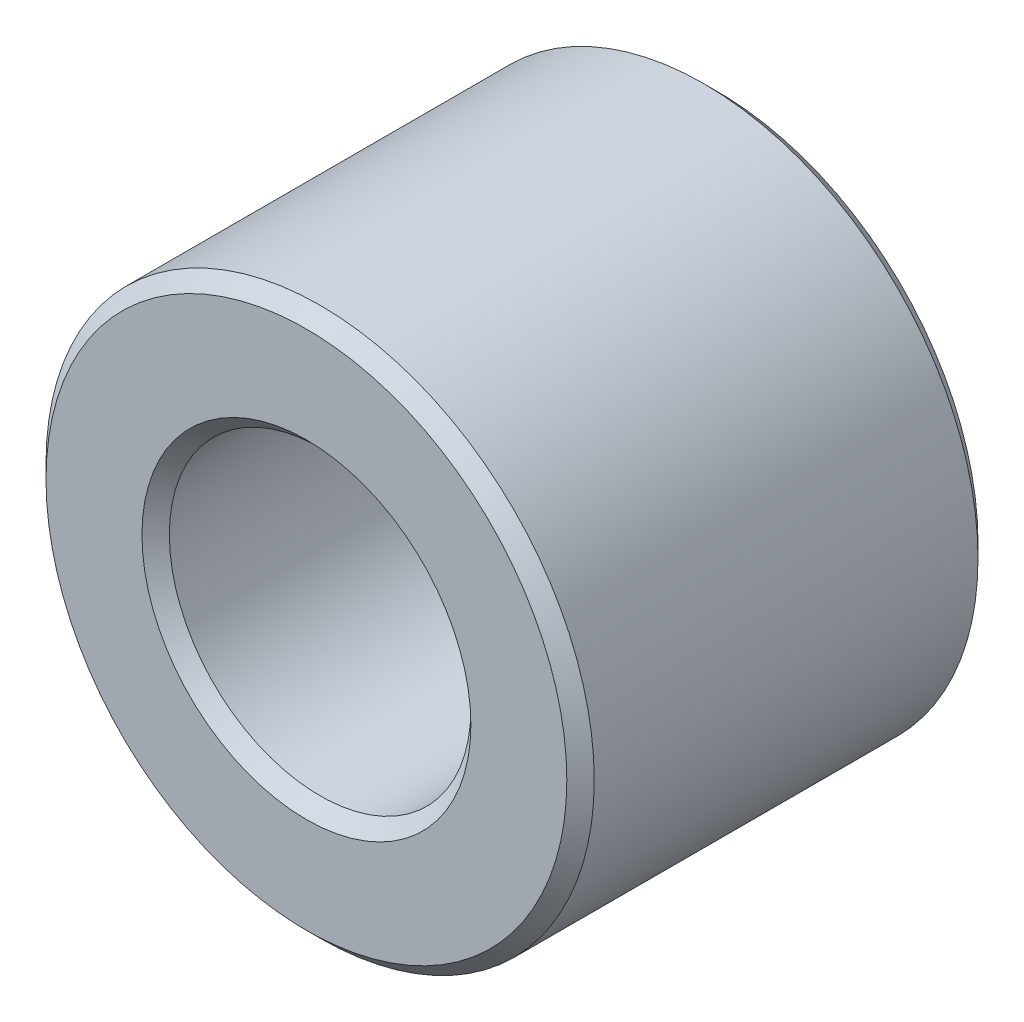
ISO-10303-21;
HEADER;
FILE_DESCRIPTION(('STEP AP214'),'2;1');
FILE_NAME('part.step','',(''),(''),'','','');
FILE_SCHEMA(('AUTOMOTIVE_DESIGN { 1 0 10303 214 1 1 1 1 }'));
ENDSEC;
DATA;
#1=APPLICATION_CONTEXT('core data for automotive mechanical design processes');
#2=APPLICATION_PROTOCOL_DEFINITION('international standard','automotive_design',2000,#1);
#3=PRODUCT_CONTEXT('',#1,'mechanical');
#4=PRODUCT('Part','Part','',(#3));
#5=PRODUCT_RELATED_PRODUCT_CATEGORY('part','',(#4));
#6=PRODUCT_DEFINITION_FORMATION('','',#4);
#7=PRODUCT_DEFINITION_CONTEXT('part definition',#1,'design');
#8=PRODUCT_DEFINITION('design','',#6,#7);
#9=PRODUCT_DEFINITION_SHAPE('','',#8);
#10=(LENGTH_UNIT() NAMED_UNIT(*) SI_UNIT(.MILLI.,.METRE.));
#11=(NAMED_UNIT(*) PLANE_ANGLE_UNIT() SI_UNIT($,.RADIAN.));
#12=(NAMED_UNIT(*) SI_UNIT($,.STERADIAN.) SOLID_ANGLE_UNIT());
#13=UNCERTAINTY_MEASURE_WITH_UNIT(LENGTH_MEASURE(1.E-05),#10,'distance_accuracy_value','');
#14=(GEOMETRIC_REPRESENTATION_CONTEXT(3) GLOBAL_UNCERTAINTY_ASSIGNED_CONTEXT((#13)) GLOBAL_UNIT_ASSIGNED_CONTEXT((#10,
#11,#12)) REPRESENTATION_CONTEXT('',''));
#15=CARTESIAN_POINT('',(0.,0.,0.));
#16=DIRECTION('',(0.,0.,1.));
#17=DIRECTION('',(1.,0.,0.));
#18=AXIS2_PLACEMENT_3D('',#15,#16,#17);
#19=CARTESIAN_POINT('',(0.,0.,1.5));
#20=DIRECTION('',(0.,0.,1.));
#21=DIRECTION('',(1.,0.,0.));
#22=AXIS2_PLACEMENT_3D('',#19,#20,#21);
#23=PLANE('',#22);
#24=CARTESIAN_POINT('',(0.,0.,1.5));
#25=DIRECTION('',(0.,0.,1.));
#26=DIRECTION('',(1.,0.,0.));
#27=AXIS2_PLACEMENT_3D('',#24,#25,#26);
#28=CIRCLE('',#27,1.2);
#29=CARTESIAN_POINT('',(1.2,0.,1.5));
#30=VERTEX_POINT('',#29);
#31=EDGE_CURVE('E10',#30,#30,#28,.F.);
#32=ORIENTED_EDGE('',*,*,#31,.T.);
#33=EDGE_LOOP('',(#32));
#34=FACE_BOUND('',#33,.T.);
#35=CARTESIAN_POINT('',(0.,0.,1.5));
#36=DIRECTION('',(0.,0.,1.));
#37=DIRECTION('',(1.,0.,0.));
#38=AXIS2_PLACEMENT_3D('',#35,#36,#37);
#39=CIRCLE('',#38,1.9);
#40=CARTESIAN_POINT('',(1.9,0.,1.5));
#41=VERTEX_POINT('',#40);
#42=EDGE_CURVE('E37',#41,#41,#39,.T.);
#43=ORIENTED_EDGE('',*,*,#42,.T.);
#44=EDGE_LOOP('',(#43));
#45=FACE_BOUND('',#44,.T.);
#46=ADVANCED_FACE('F30',(#34,#45),#23,.T.);
#47=CARTESIAN_POINT('',(0.,0.,-1.5));
#48=DIRECTION('',(0.,0.,1.));
#49=DIRECTION('',(1.,0.,0.));
#50=AXIS2_PLACEMENT_3D('',#47,#48,#49);
#51=PLANE('',#50);
#52=CARTESIAN_POINT('',(0.,0.,-1.5));
#53=DIRECTION('',(0.,0.,1.));
#54=DIRECTION('',(1.,0.,0.));
#55=AXIS2_PLACEMENT_3D('',#52,#53,#54);
#56=CIRCLE('',#55,1.9);
#57=CARTESIAN_POINT('',(1.9,0.,-1.5));
#58=VERTEX_POINT('',#57);
#59=EDGE_CURVE('E50',#58,#58,#56,.F.);
#60=ORIENTED_EDGE('',*,*,#59,.T.);
#61=EDGE_LOOP('',(#60));
#62=FACE_BOUND('',#61,.T.);
#63=CARTESIAN_POINT('',(0.,0.,-1.5));
#64=DIRECTION('',(0.,0.,1.));
#65=DIRECTION('',(1.,0.,0.));
#66=AXIS2_PLACEMENT_3D('',#63,#64,#65);
#67=CIRCLE('',#66,1.2);
#68=CARTESIAN_POINT('',(-1.2,0.,-1.5));
#69=VERTEX_POINT('',#68);
#70=EDGE_CURVE('E53',#69,#69,#67,.T.);
#71=ORIENTED_EDGE('',*,*,#70,.T.);
#72=EDGE_LOOP('',(#71));
#73=FACE_BOUND('',#72,.T.);
#74=ADVANCED_FACE('F74',(#62,#73),#51,.F.);
#75=CARTESIAN_POINT('',(0.,0.,1.5));
#76=DIRECTION('',(0.,0.,-1.));
#77=DIRECTION('',(-1.,0.,0.));
#78=AXIS2_PLACEMENT_3D('',#75,#76,#77);
#79=CYLINDRICAL_SURFACE('',#78,2.);
#80=CARTESIAN_POINT('',(0.,0.,-1.4));
#81=DIRECTION('',(0.,0.,1.));
#82=DIRECTION('',(1.,0.,0.));
#83=AXIS2_PLACEMENT_3D('',#80,#81,#82);
#84=CIRCLE('',#83,2.);
#85=CARTESIAN_POINT('',(2.,0.,-1.4));
#86=VERTEX_POINT('',#85);
#87=EDGE_CURVE('E56',#86,#86,#84,.T.);
#88=ORIENTED_EDGE('',*,*,#87,.T.);
#89=EDGE_LOOP('',(#88));
#90=FACE_BOUND('',#89,.T.);
#91=CARTESIAN_POINT('',(0.,0.,1.4));
#92=DIRECTION('',(0.,0.,1.));
#93=DIRECTION('',(1.,0.,0.));
#94=AXIS2_PLACEMENT_3D('',#91,#92,#93);
#95=CIRCLE('',#94,2.);
#96=CARTESIAN_POINT('',(2.,0.,1.4));
#97=VERTEX_POINT('',#96);
#98=EDGE_CURVE('E59',#97,#97,#95,.F.);
#99=ORIENTED_EDGE('',*,*,#98,.T.);
#100=EDGE_LOOP('',(#99));
#101=FACE_BOUND('',#100,.T.);
#102=ADVANCED_FACE('F63',(#90,#101),#79,.T.);
#103=CARTESIAN_POINT('',(0.,0.,1.5));
#104=DIRECTION('',(0.,0.,-1.));
#105=DIRECTION('',(-1.,0.,0.));
#106=AXIS2_PLACEMENT_3D('',#103,#104,#105);
#107=CYLINDRICAL_SURFACE('',#106,1.1);
#108=CARTESIAN_POINT('',(0.,0.,-1.4));
#109=DIRECTION('',(0.,0.,1.));
#110=DIRECTION('',(1.,0.,0.));
#111=AXIS2_PLACEMENT_3D('',#108,#109,#110);
#112=CIRCLE('',#111,1.1);
#113=CARTESIAN_POINT('',(-1.1,0.,-1.4));
#114=VERTEX_POINT('',#113);
#115=EDGE_CURVE('E41',#114,#114,#112,.F.);
#116=ORIENTED_EDGE('',*,*,#115,.T.);
#117=EDGE_LOOP('',(#116));
#118=FACE_BOUND('',#117,.T.);
#119=CARTESIAN_POINT('',(0.,0.,1.4));
#120=DIRECTION('',(0.,0.,1.));
#121=DIRECTION('',(1.,0.,0.));
#122=AXIS2_PLACEMENT_3D('',#119,#120,#121);
#123=CIRCLE('',#122,1.1);
#124=CARTESIAN_POINT('',(1.1,0.,1.4));
#125=VERTEX_POINT('',#124);
#126=EDGE_CURVE('E45',#125,#125,#123,.T.);
#127=ORIENTED_EDGE('',*,*,#126,.T.);
#128=EDGE_LOOP('',(#127));
#129=FACE_BOUND('',#128,.T.);
#130=ADVANCED_FACE('F82',(#118,#129),#107,.F.);
#131=CARTESIAN_POINT('',(0.,0.,-1.4));
#132=DIRECTION('',(0.,0.,1.));
#133=DIRECTION('',(1.,0.,0.));
#134=AXIS2_PLACEMENT_3D('',#131,#132,#133);
#135=CONICAL_SURFACE('',#134,2.,0.78539816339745);
#136=ORIENTED_EDGE('',*,*,#59,.F.);
#137=EDGE_LOOP('',(#136));
#138=FACE_BOUND('',#137,.T.);
#139=ORIENTED_EDGE('',*,*,#87,.F.);
#140=EDGE_LOOP('',(#139));
#141=FACE_BOUND('',#140,.T.);
#142=ADVANCED_FACE('F87',(#138,#141),#135,.T.);
#143=CARTESIAN_POINT('',(0.,0.,-1.5));
#144=DIRECTION('',(0.,0.,-1.));
#145=DIRECTION('',(-1.,0.,0.));
#146=AXIS2_PLACEMENT_3D('',#143,#144,#145);
#147=CONICAL_SURFACE('',#146,1.2,0.785398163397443);
#148=CARTESIAN_POINT('',(-1.1,0.,-1.4));
#149=CARTESIAN_POINT('',(-1.10104166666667,0.,-1.40104166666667));
#150=CARTESIAN_POINT('',(-1.10208333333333,0.,-1.40208333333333));
#151=CARTESIAN_POINT('',(-1.10416666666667,0.,-1.40416666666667));
#152=CARTESIAN_POINT('',(-1.10520833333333,0.,-1.40520833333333));
#153=CARTESIAN_POINT('',(-1.10729166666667,0.,-1.40729166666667));
#154=CARTESIAN_POINT('',(-1.10833333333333,0.,-1.40833333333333));
#155=CARTESIAN_POINT('',(-1.11041666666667,0.,-1.41041666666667));
#156=CARTESIAN_POINT('',(-1.11145833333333,0.,-1.41145833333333));
#157=CARTESIAN_POINT('',(-1.11354166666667,0.,-1.41354166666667));
#158=CARTESIAN_POINT('',(-1.11458333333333,0.,-1.41458333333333));
#159=CARTESIAN_POINT('',(-1.11666666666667,0.,-1.41666666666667));
#160=CARTESIAN_POINT('',(-1.11770833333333,0.,-1.41770833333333));
#161=CARTESIAN_POINT('',(-1.11979166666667,0.,-1.41979166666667));
#162=CARTESIAN_POINT('',(-1.12083333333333,0.,-1.42083333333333));
#163=CARTESIAN_POINT('',(-1.12291666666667,0.,-1.42291666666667));
#164=CARTESIAN_POINT('',(-1.12395833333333,0.,-1.42395833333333));
#165=CARTESIAN_POINT('',(-1.12604166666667,0.,-1.42604166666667));
#166=CARTESIAN_POINT('',(-1.12708333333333,0.,-1.42708333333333));
#167=CARTESIAN_POINT('',(-1.12916666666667,0.,-1.42916666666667));
#168=CARTESIAN_POINT('',(-1.13020833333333,0.,-1.43020833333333));
#169=CARTESIAN_POINT('',(-1.13229166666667,0.,-1.43229166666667));
#170=CARTESIAN_POINT('',(-1.13333333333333,0.,-1.43333333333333));
#171=CARTESIAN_POINT('',(-1.13541666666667,0.,-1.43541666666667));
#172=CARTESIAN_POINT('',(-1.13645833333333,0.,-1.43645833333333));
#173=CARTESIAN_POINT('',(-1.13854166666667,0.,-1.43854166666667));
#174=CARTESIAN_POINT('',(-1.13958333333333,0.,-1.43958333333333));
#175=CARTESIAN_POINT('',(-1.14166666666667,0.,-1.44166666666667));
#176=CARTESIAN_POINT('',(-1.14270833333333,0.,-1.44270833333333));
#177=CARTESIAN_POINT('',(-1.14479166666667,0.,-1.44479166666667));
#178=CARTESIAN_POINT('',(-1.14583333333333,0.,-1.44583333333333));
#179=CARTESIAN_POINT('',(-1.14791666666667,0.,-1.44791666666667));
#180=CARTESIAN_POINT('',(-1.14895833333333,0.,-1.44895833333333));
#181=CARTESIAN_POINT('',(-1.15104166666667,0.,-1.45104166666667));
#182=CARTESIAN_POINT('',(-1.15208333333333,0.,-1.45208333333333));
#183=CARTESIAN_POINT('',(-1.15416666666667,0.,-1.45416666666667));
#184=CARTESIAN_POINT('',(-1.15520833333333,0.,-1.45520833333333));
#185=CARTESIAN_POINT('',(-1.15729166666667,0.,-1.45729166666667));
#186=CARTESIAN_POINT('',(-1.15833333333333,0.,-1.45833333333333));
#187=CARTESIAN_POINT('',(-1.16041666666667,0.,-1.46041666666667));
#188=CARTESIAN_POINT('',(-1.16145833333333,0.,-1.46145833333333));
#189=CARTESIAN_POINT('',(-1.16354166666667,0.,-1.46354166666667));
#190=CARTESIAN_POINT('',(-1.16458333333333,0.,-1.46458333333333));
#191=CARTESIAN_POINT('',(-1.16666666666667,0.,-1.46666666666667));
#192=CARTESIAN_POINT('',(-1.16770833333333,0.,-1.46770833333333));
#193=CARTESIAN_POINT('',(-1.16979166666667,0.,-1.46979166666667));
#194=CARTESIAN_POINT('',(-1.17083333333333,0.,-1.47083333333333));
#195=CARTESIAN_POINT('',(-1.17291666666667,0.,-1.47291666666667));
#196=CARTESIAN_POINT('',(-1.17395833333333,0.,-1.47395833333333));
#197=CARTESIAN_POINT('',(-1.17604166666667,0.,-1.47604166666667));
#198=CARTESIAN_POINT('',(-1.17708333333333,0.,-1.47708333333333));
#199=CARTESIAN_POINT('',(-1.17916666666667,0.,-1.47916666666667));
#200=CARTESIAN_POINT('',(-1.18020833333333,0.,-1.48020833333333));
#201=CARTESIAN_POINT('',(-1.18229166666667,0.,-1.48229166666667));
#202=CARTESIAN_POINT('',(-1.18333333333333,0.,-1.48333333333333));
#203=CARTESIAN_POINT('',(-1.18541666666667,0.,-1.48541666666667));
#204=CARTESIAN_POINT('',(-1.18645833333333,0.,-1.48645833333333));
#205=CARTESIAN_POINT('',(-1.18854166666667,0.,-1.48854166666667));
#206=CARTESIAN_POINT('',(-1.18958333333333,0.,-1.48958333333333));
#207=CARTESIAN_POINT('',(-1.19166666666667,0.,-1.49166666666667));
#208=CARTESIAN_POINT('',(-1.19270833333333,0.,-1.49270833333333));
#209=CARTESIAN_POINT('',(-1.19479166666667,0.,-1.49479166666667));
#210=CARTESIAN_POINT('',(-1.19583333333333,0.,-1.49583333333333));
#211=CARTESIAN_POINT('',(-1.19791666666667,0.,-1.49791666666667));
#212=CARTESIAN_POINT('',(-1.19895833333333,0.,-1.49895833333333));
#213=CARTESIAN_POINT('',(-1.2,0.,-1.5));
#214=B_SPLINE_CURVE_WITH_KNOTS('',3,(#148,#149,#150,#151,#152,#153,#154,#155,#156,#157,#158,
#159,#160,#161,#162,#163,#164,#165,#166,#167,#168,#169,#170,#171,#172,#173,#174,#175,#176,#177,
#178,#179,#180,#181,#182,#183,#184,#185,#186,#187,#188,#189,#190,#191,#192,#193,#194,#195,#196,
#197,#198,#199,#200,#201,#202,#203,#204,#205,#206,#207,#208,#209,#210,#211,#212,#213),
.UNSPECIFIED.,.F.,.F.,(4,2,2,2,2,2,2,2,2,2,2,2,2,2,2,2,2,2,2,2,2,2,2,2,2,2,2,2,2,2,2,2,4),(0.,
0.00441941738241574,0.00883883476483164,0.0132582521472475,0.0176776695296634,
0.0220970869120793,0.0265165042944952,0.0309359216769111,0.035355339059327,0.0397747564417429,
0.0441941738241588,0.0486135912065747,0.0530330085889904,0.0574524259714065,0.0618718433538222,
0.0662912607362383,0.0707106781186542,0.0751300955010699,0.079549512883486,0.0839689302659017,
0.0883883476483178,0.0928077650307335,0.0972271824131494,0.101646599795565,0.106066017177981,
0.110485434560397,0.114904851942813,0.119324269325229,0.123743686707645,0.128163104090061,
0.132582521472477,0.137001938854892,0.141421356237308),.UNSPECIFIED.);
#215=EDGE_CURVE('BSEAM71',#114,#69,#214,.T.);
#216=ORIENTED_EDGE('',*,*,#115,.F.);
#217=ORIENTED_EDGE('',*,*,#70,.F.);
#218=ORIENTED_EDGE('',*,*,#215,.T.);
#219=ORIENTED_EDGE('',*,*,#215,.F.);
#220=EDGE_LOOP('',(#216,#218,#217,#219));
#221=FACE_BOUND('',#220,.T.);
#222=ADVANCED_FACE('F71',(#221),#147,.F.);
#223=CARTESIAN_POINT('',(0.,0.,1.4));
#224=DIRECTION('',(0.,0.,1.));
#225=DIRECTION('',(1.,0.,0.));
#226=AXIS2_PLACEMENT_3D('',#223,#224,#225);
#227=CONICAL_SURFACE('',#226,1.1,0.785398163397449);
#228=ORIENTED_EDGE('',*,*,#31,.F.);
#229=EDGE_LOOP('',(#228));
#230=FACE_BOUND('',#229,.T.);
#231=ORIENTED_EDGE('',*,*,#126,.F.);
#232=EDGE_LOOP('',(#231));
#233=FACE_BOUND('',#232,.T.);
#234=ADVANCED_FACE('F67',(#230,#233),#227,.F.);
#235=CARTESIAN_POINT('',(0.,0.,1.5));
#236=DIRECTION('',(0.,0.,-1.));
#237=DIRECTION('',(-1.,0.,0.));
#238=AXIS2_PLACEMENT_3D('',#235,#236,#237);
#239=CONICAL_SURFACE('',#238,1.9,0.785398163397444);
#240=ORIENTED_EDGE('',*,*,#98,.F.);
#241=EDGE_LOOP('',(#240));
#242=FACE_BOUND('',#241,.T.);
#243=ORIENTED_EDGE('',*,*,#42,.F.);
#244=EDGE_LOOP('',(#243));
#245=FACE_BOUND('',#244,.T.);
#246=ADVANCED_FACE('F32',(#242,#245),#239,.T.);
#247=CLOSED_SHELL('',(#46,#74,#102,#130,#142,#222,#234,#246));
#248=MANIFOLD_SOLID_BREP('B2',#247);
#249=ADVANCED_BREP_SHAPE_REPRESENTATION('',(#18,#248),#14);
#250=SHAPE_DEFINITION_REPRESENTATION(#9,#249);
ENDSEC;
END-ISO-10303-21;
